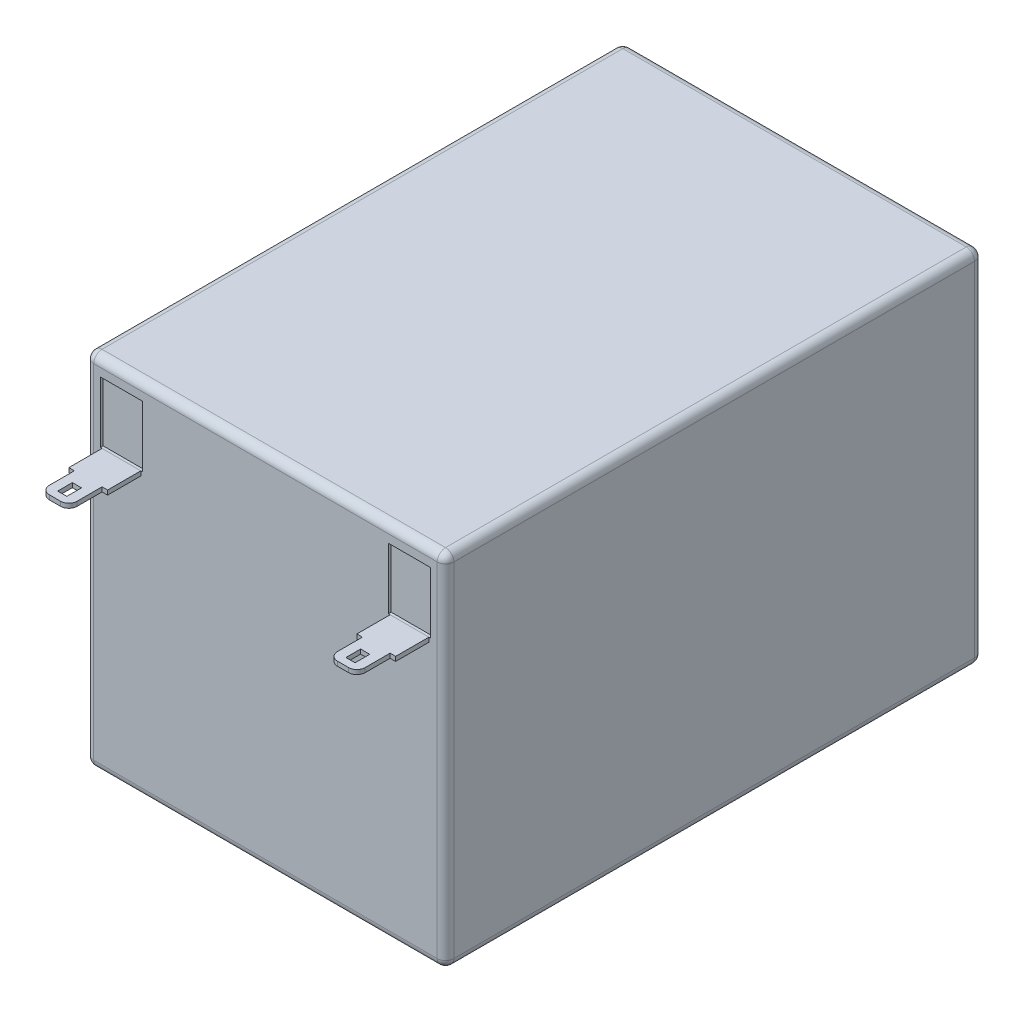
from build123d import *

# Parameters (mm, degrees)
ESQUISSE1_W             = 65
ESQUISSE1_H             = 65
BOSS_EXTRU_1_DEPTH      = 97
CONG_1_R                = 1.5
ESQUISSE2_W             = 7
ESQUISSE2_H             = 0.8
BOSS_EXTRU_2_DEPTH      = 12
ESQUISSE3_W             = 1.651263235
ESQUISSE3_H             = 2.654972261
ENL_V_MAT_EXTRU_1_DEPTH = 134.868257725
CONG_2_R                = 1.5
ESQUISSE4_W             = 7.611162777
ESQUISSE4_H             = 11.032212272
ENL_V_MAT_EXTRU_2_DEPTH = 0.5


with BuildPart() as part:
    # Esquisse1 → Boss.-Extru.1 (new body)
    with BuildSketch(Plane.XY):
        with Locations((10.099418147, 10.824943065)):
            Rectangle(ESQUISSE1_W, ESQUISSE1_H)
    extrude(amount=BOSS_EXTRU_1_DEPTH)

    # Cong_1
    cong_1_edges = [part.edges().sort_by_distance(p)[0] for p in [
        (42.599418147, 10.824943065, 97),
        (10.099418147, 43.324943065, 97),
        (-22.400581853, 10.824943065, 97),
        (10.099418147, 43.324943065, 0),
        (42.599418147, 10.824943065, 0),
        (10.099418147, -21.675056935, 0),
        (-22.400581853, 10.824943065, 0),
        (10.099418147, -21.675056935, 97),
        (-22.400581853, 43.324943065, 48.5),
        (42.599418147, 43.324943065, 48.5),
        (42.599418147, -21.675056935, 48.5),
        (-22.400581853, -21.675056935, 48.5),
    ]]
    fillet(cong_1_edges, radius=CONG_1_R)

    # Esquisse2 → Boss.-Extru.2 (add)
    with BuildSketch(Plane.XY.offset(97)):
        with Locations((36.099418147, 28.924943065)):
            Rectangle(ESQUISSE2_W, ESQUISSE2_H)
        with Locations((-15.900581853, 28.924943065)):
            Rectangle(ESQUISSE2_W, ESQUISSE2_H)
    extrude(amount=BOSS_EXTRU_2_DEPTH)

    # Esquisse3 → Enl_v. mat.-Extru.1 (cut, through all)
    with BuildSketch(Plane(origin=(0, 43.324943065, 0), x_dir=(1, 0, 0), z_dir=(0, 1, 0))):
        Polygon((36.099418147, -109.614729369), (38.599418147, -109.614729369), (38.599418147, -103), (43.740422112, -103), (43.740422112, -111.265992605), (-23.541585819, -111.265992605), (-23.541585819, -103), (-18.400581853, -103), (-18.400581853, -109.614729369), (-15.900581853, -109.614729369), (-13.400581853, -109.614729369), (-13.400581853, -103), (-11.060425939, -103), (-11.060425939, -109.614729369), (31.259262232, -109.614729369), (31.259262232, -103), (33.599418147, -103), (33.599418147, -109.614729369), align=None)
        with Locations((-15.916634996, -106.344580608)):
            Rectangle(ESQUISSE3_W, ESQUISSE3_H)
        with Locations((36.115471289, -106.344580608)):
            Rectangle(ESQUISSE3_W, ESQUISSE3_H)
    extrude(amount=-ENL_V_MAT_EXTRU_1_DEPTH, mode=Mode.SUBTRACT)

    # Cong_2
    cong_2_edges = [part.edges().sort_by_distance(p)[0] for p in [
        (33.599418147, 28.924943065, 109),
        (38.599418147, 28.924943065, 109),
        (-13.400581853, 28.924943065, 109),
        (-18.400581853, 28.924943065, 109),
    ]]
    fillet(cong_2_edges, radius=CONG_2_R)

    # Esquisse4 → Enl_v. mat.-Extru.2 (cut)
    with BuildSketch(Plane.XY.offset(97)):
        with Locations((36.083326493, 34.841151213)):
            Rectangle(ESQUISSE4_W, ESQUISSE4_H)
        with Locations((-15.8844902, 34.841151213)):
            Rectangle(ESQUISSE4_W, ESQUISSE4_H)
    extrude(amount=-ENL_V_MAT_EXTRU_2_DEPTH, mode=Mode.SUBTRACT)


solid = part.part
